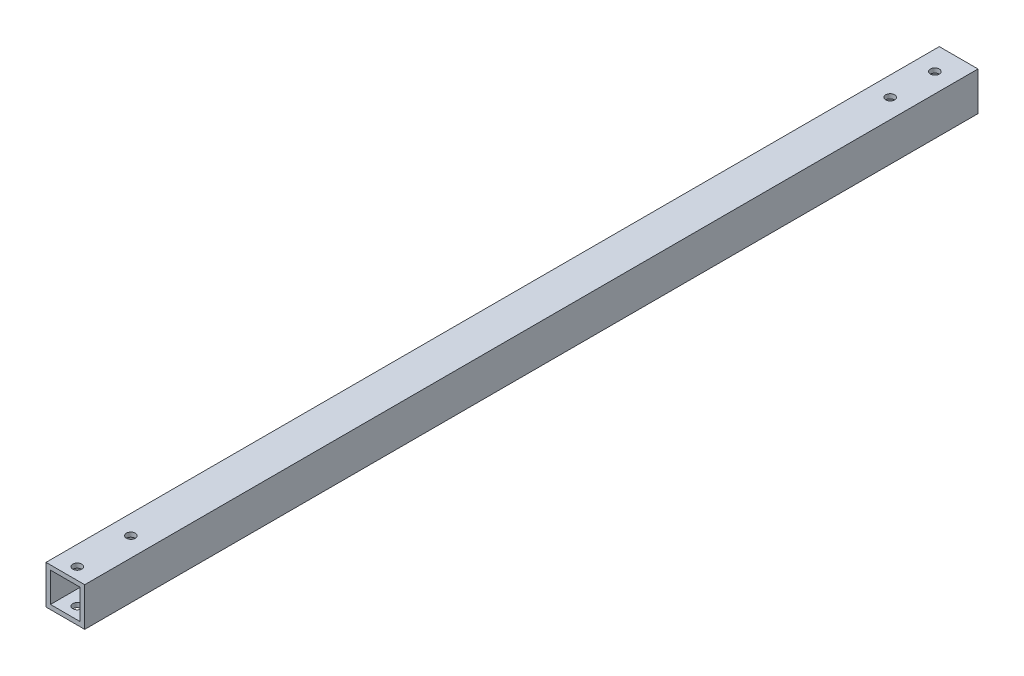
from build123d import *

# Parameters (mm, degrees)
SKETCH_1_W          = 13
SKETCH_1_H          = 13
EXTRUDE_1_DEPTH     = 300
SHELL_1_T           = -1.5
SKETCH_2_R          = 1.5
CUT_EXTRUDE_1_DEPTH = 301.351876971


with BuildPart() as part:
    # Sketch 1 → Extrude 1 (new body)
    with BuildSketch(Plane.XY):
        Rectangle(SKETCH_1_W, SKETCH_1_H)
    extrude(amount=EXTRUDE_1_DEPTH)

    # Shell 1
    shell_1_openings = [part.faces().sort_by_distance(p)[0] for p in [
        (0, 0, 300),
        (0, 0, 0),
    ]]
    offset(amount=SHELL_1_T, openings=shell_1_openings, kind=Kind.INTERSECTION)

    # Sketch 2 → Cut-Extrude 1 (cut, through all)
    with BuildSketch(Plane(origin=(0, 6.5, 0), x_dir=(1, 0, 0), z_dir=(0, 1, 0))):
        with Locations(Location((0, -8, 0), (0, 0, 270))):
            Circle(SKETCH_2_R)
        with Locations(Location((0, -23, 0), (0, 0, 270))):
            Circle(SKETCH_2_R)
        with Locations(Location((0, -296, 0), (0, 0, 270))):
            Circle(SKETCH_2_R)
        with Locations(Location((0, -278, 0), (0, 0, 270))):
            Circle(SKETCH_2_R)
    extrude(amount=-CUT_EXTRUDE_1_DEPTH, mode=Mode.SUBTRACT)


solid = part.part
